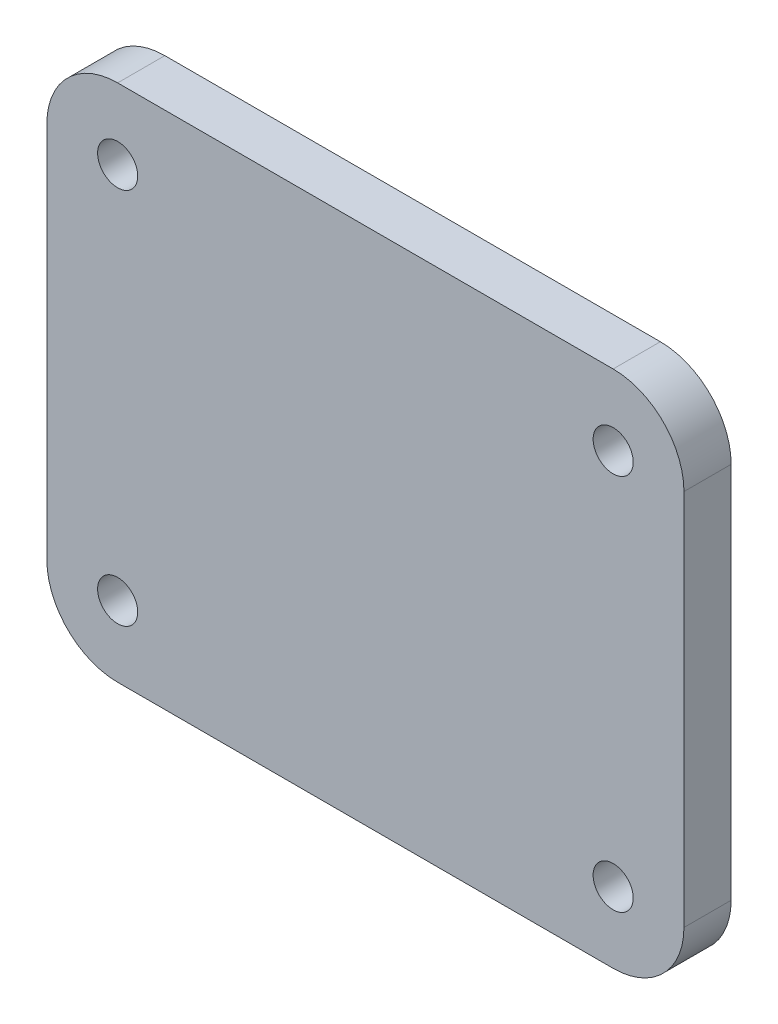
from build123d import *

# Parameters (mm, degrees)
ESQUISSE1_W                     = 135
ESQUISSE1_H                     = 110
BOSS_EXTRU_1_DEPTH              = 10
TROU_TARAUD_M101_D              = 8.5
R_P_TITION_LIN_AIRE1_COUNT      = 2
R_P_TITION_LIN_AIRE1_PITCH      = 105
R_P_TITION_LIN_AIRE1_COUNT_DIR2 = 2
R_P_TITION_LIN_AIRE1_PITCH_DIR2 = 80
CONG_1_R                        = 15


with BuildPart() as part:
    # Esquisse1 → Boss.-Extru.1 (new body)
    with BuildSketch(Plane.XY):
        Rectangle(ESQUISSE1_W, ESQUISSE1_H)
    extrude(amount=BOSS_EXTRU_1_DEPTH)

    # Trou taraud_ M101 (through all)
    with Locations(Plane.XY.offset(10)):
        with Locations((-52.5, 40)):
            trou_taraud_m101 = Hole(TROU_TARAUD_M101_D / 2)

    # R_p_tition lin_aire1: Trou taraud_ M101 2 × 2
    with Locations(*[(i * R_P_TITION_LIN_AIRE1_PITCH, -j * R_P_TITION_LIN_AIRE1_PITCH_DIR2, 0) for i in range(R_P_TITION_LIN_AIRE1_COUNT) for j in range(R_P_TITION_LIN_AIRE1_COUNT_DIR2) if (i, j) != (0, 0)]):
        add(trou_taraud_m101, mode=Mode.SUBTRACT)

    # Cong_1
    cong_1_edges = [part.edges().sort_by_distance(p)[0] for p in [
        (-67.5, 55, 5),
        (67.5, 55, 5),
        (67.5, -55, 5),
        (-67.5, -55, 5),
    ]]
    fillet(cong_1_edges, radius=CONG_1_R)


solid = part.part
